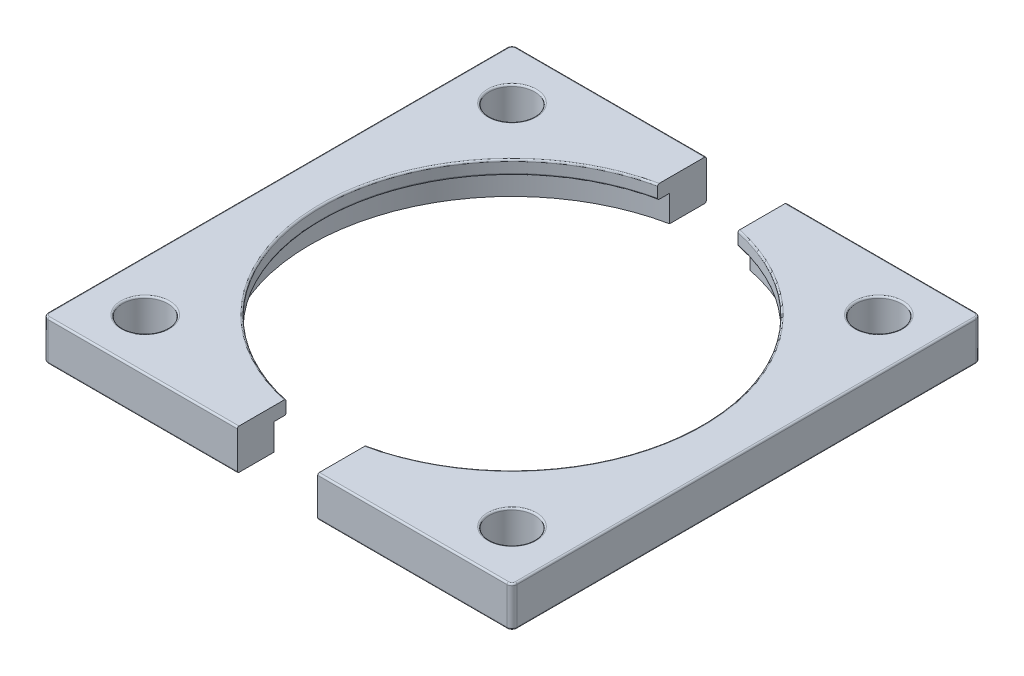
from build123d import *

# Parameters (mm, degrees)
SKETCH1_R             = 6.75
BOSS_EXTRUDE1_DEPTH   = 12
BOSS_EXTRUDE1_2_DEPTH = 12
SKETCH2_R             = 60.25
CUT_EXTRUDE1_DEPTH    = 7.9
FILLET1_R             = 0.5
FILLET2_R             = 0.5


with BuildPart() as part:
    # Sketch1 → Boss-Extrude1 (new body)
    with BuildSketch(Plane(origin=(0, 0, 0), x_dir=(1, 0, 0), z_dir=(0, 1, 0))):
        with BuildLine():
            Line((-12, 70), (-12, 55.466769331))
            ThreePointArc((-12, 55.466769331), (-56.75, 0), (-12, -55.466769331))
            Line((-12, -55.466769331), (-12, -70))
            Line((-12, -70), (-68.5, -70))
            ThreePointArc((-68.5, -70), (-69.560660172, -69.560660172), (-70, -68.5))
            Line((-70, -68.5), (-70, 68.5))
            ThreePointArc((-70, 68.5), (-69.560660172, 69.560660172), (-68.5, 70))
            Line((-68.5, 70), (-12, 70))
        make_face()
        with Locations(Location((-54.75, 54.75, 0), (0, 0, 270))):
            Circle(SKETCH1_R, mode=Mode.SUBTRACT)
        with Locations(Location((-54.75, -54.75, 0), (0, 0, 90))):
            Circle(SKETCH1_R, mode=Mode.SUBTRACT)
    extrude(amount=BOSS_EXTRUDE1_DEPTH)


with BuildPart() as body_2:
    # Sketch1 → Boss-Extrude1 2 (new body)
    with BuildSketch(Plane(origin=(0, 0, 0), x_dir=(1, 0, 0), z_dir=(0, 1, 0))):
        with BuildLine():
            Line((70, 68.5), (70, -68.5))
            ThreePointArc((70, -68.5), (69.560660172, -69.560660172), (68.5, -70))
            Line((68.5, -70), (12, -70))
            Line((12, -70), (12, -55.466769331))
            ThreePointArc((12, -55.466769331), (56.75, 0), (12, 55.466769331))
            Line((12, 55.466769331), (12, 70))
            Line((12, 70), (68.5, 70))
            ThreePointArc((68.5, 70), (69.560660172, 69.560660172), (70, 68.5))
        make_face()
        with Locations(Location((54.75, 54.75, 0), (0, 0, 90))):
            Circle(SKETCH1_R, mode=Mode.SUBTRACT)
        with Locations(Location((54.75, -54.75, 0), (0, 0, 270))):
            Circle(SKETCH1_R, mode=Mode.SUBTRACT)
    extrude(amount=BOSS_EXTRUDE1_2_DEPTH)


with BuildPart() as cut_extrude1_tool:
    # Sketch2 → Cut-Extrude1 (new body)
    with BuildSketch(Plane.XZ):
        Circle(SKETCH2_R)
    extrude(amount=-CUT_EXTRUDE1_DEPTH)


with BuildPart() as part_1:
    add(part.part)

    # Cut-Extrude1: cut by cut_extrude1_tool
    add(cut_extrude1_tool.part, mode=Mode.SUBTRACT)

    # Fillet1
    fillet1_edges = [part_1.edges().sort_by_distance(p)[0] for p in [
        (-40.25, 0, 70),
        (-69.560660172, 0, 69.560660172),
        (-56.75, 12, 0),
        (-40.25, 12, -70),
        (-54.75, 12, -61.5),
        (-69.560660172, 12, -69.560660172),
        (-54.75, 12, 61.5),
        (-70, 12, 0),
        (-56.75, 7.9, 0),
        (-69.560660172, 12, 69.560660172),
        (-40.25, 12, 70),
        (-70, 0, 0),
        (-69.560660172, 0, -69.560660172),
        (-40.25, 0, -70),
    ]]
    fillet(fillet1_edges, radius=FILLET1_R)


with BuildPart() as body_2_1:
    add(body_2.part)

    # Cut-Extrude1: cut by cut_extrude1_tool
    add(cut_extrude1_tool.part, mode=Mode.SUBTRACT)

    # Fillet2
    fillet2_edges = [body_2_1.edges().sort_by_distance(p)[0] for p in [
        (69.560660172, 12, -69.560660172),
        (70, 0, 0),
        (69.560660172, 0, 69.560660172),
        (40.25, 12, -70),
        (56.75, 12, 0),
        (54.75, 12, -48),
        (54.75, 12, 48),
        (40.25, 12, 70),
        (56.75, 7.9, 0),
        (69.560660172, 12, 69.560660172),
        (70, 12, 0),
        (40.25, 0, 70),
        (40.25, 0, -70),
        (69.560660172, 0, -69.560660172),
    ]]
    fillet(fillet2_edges, radius=FILLET2_R)


solid = Compound([part_1.part, body_2_1.part])
